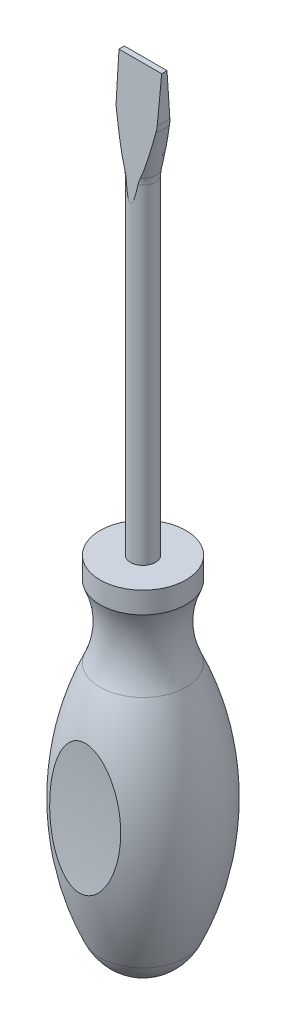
ISO-10303-21;
HEADER;
FILE_DESCRIPTION(('STEP AP214'),'2;1');
FILE_NAME('part.step','',(''),(''),'','','');
FILE_SCHEMA(('AUTOMOTIVE_DESIGN { 1 0 10303 214 1 1 1 1 }'));
ENDSEC;
DATA;
#1=APPLICATION_CONTEXT('core data for automotive mechanical design processes');
#2=APPLICATION_PROTOCOL_DEFINITION('international standard','automotive_design',2000,#1);
#3=PRODUCT_CONTEXT('',#1,'mechanical');
#4=PRODUCT('Part','Part','',(#3));
#5=PRODUCT_RELATED_PRODUCT_CATEGORY('part','',(#4));
#6=PRODUCT_DEFINITION_FORMATION('','',#4);
#7=PRODUCT_DEFINITION_CONTEXT('part definition',#1,'design');
#8=PRODUCT_DEFINITION('design','',#6,#7);
#9=PRODUCT_DEFINITION_SHAPE('','',#8);
#10=(LENGTH_UNIT() NAMED_UNIT(*) SI_UNIT(.MILLI.,.METRE.));
#11=(NAMED_UNIT(*) PLANE_ANGLE_UNIT() SI_UNIT($,.RADIAN.));
#12=(NAMED_UNIT(*) SI_UNIT($,.STERADIAN.) SOLID_ANGLE_UNIT());
#13=UNCERTAINTY_MEASURE_WITH_UNIT(LENGTH_MEASURE(1.E-05),#10,'distance_accuracy_value','');
#14=(GEOMETRIC_REPRESENTATION_CONTEXT(3) GLOBAL_UNCERTAINTY_ASSIGNED_CONTEXT((#13)) GLOBAL_UNIT_ASSIGNED_CONTEXT((#10,
#11,#12)) REPRESENTATION_CONTEXT('',''));
#15=CARTESIAN_POINT('',(0.,0.,0.));
#16=DIRECTION('',(0.,0.,1.));
#17=DIRECTION('',(1.,0.,0.));
#18=AXIS2_PLACEMENT_3D('',#15,#16,#17);
#19=CARTESIAN_POINT('',(0.,41.25,0.));
#20=DIRECTION('',(0.,1.,0.));
#21=DIRECTION('',(0.,0.,1.));
#22=AXIS2_PLACEMENT_3D('',#19,#20,#21);
#23=DEGENERATE_TOROIDAL_SURFACE('',#22,60.8075269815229,79.834193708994,.F.);
#24=CARTESIAN_POINT('',(0.,8.50000000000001,0.));
#25=DIRECTION('',(0.,1.,0.));
#26=DIRECTION('',(0.,0.,1.));
#27=AXIS2_PLACEMENT_3D('',#24,#25,#26);
#28=CIRCLE('',#27,12.);
#29=CARTESIAN_POINT('',(0.,8.50000000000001,12.));
#30=VERTEX_POINT('',#29);
#31=EDGE_CURVE('E167',#30,#30,#28,.T.);
#32=ORIENTED_EDGE('',*,*,#31,.T.);
#33=EDGE_LOOP('',(#32));
#34=FACE_BOUND('',#33,.T.);
#35=CARTESIAN_POINT('',(0.,74.,0.));
#36=DIRECTION('',(0.,1.,0.));
#37=DIRECTION('',(0.,0.,1.));
#38=AXIS2_PLACEMENT_3D('',#35,#36,#37);
#39=CIRCLE('',#38,12.);
#40=CARTESIAN_POINT('',(0.,74.,12.));
#41=VERTEX_POINT('',#40);
#42=EDGE_CURVE('E170',#41,#41,#39,.T.);
#43=ORIENTED_EDGE('',*,*,#42,.F.);
#44=EDGE_LOOP('',(#43));
#45=FACE_BOUND('',#44,.T.);
#46=CARTESIAN_POINT('',(-7.72043957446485,33.5090740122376,-16.9775024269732));
#47=CARTESIAN_POINT('',(-7.47341911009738,32.970534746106,-17.0322042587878));
#48=CARTESIAN_POINT('',(-7.20158457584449,32.4432461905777,-17.0879841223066));
#49=CARTESIAN_POINT('',(-6.75160292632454,31.6765659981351,-17.1719991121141));
#50=CARTESIAN_POINT('',(-6.59438050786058,31.4247926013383,-17.2000917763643));
#51=CARTESIAN_POINT('',(-6.26490240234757,30.93129914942,-17.2560688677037));
#52=CARTESIAN_POINT('',(-6.09265069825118,30.689576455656,-17.2839533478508));
#53=CARTESIAN_POINT('',(-5.72980185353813,30.215421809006,-17.3394878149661));
#54=CARTESIAN_POINT('',(-5.53900700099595,29.983138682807,-17.3671308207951));
#55=CARTESIAN_POINT('',(-5.13991651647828,29.53408335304,-17.4213179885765));
#56=CARTESIAN_POINT('',(-4.9316167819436,29.3173148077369,-17.4478618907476));
#57=CARTESIAN_POINT('',(-4.2799871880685,28.6969564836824,-17.5247874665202));
#58=CARTESIAN_POINT('',(-3.80820482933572,28.320967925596,-17.5727410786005));
#59=CARTESIAN_POINT('',(-3.00166198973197,27.8188960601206,-17.6378285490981));
#60=CARTESIAN_POINT('',(-2.6915299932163,27.6539155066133,-17.659485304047));
#61=CARTESIAN_POINT('',(-2.20966296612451,27.4443886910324,-17.6871780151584));
#62=CARTESIAN_POINT('',(-2.04625264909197,27.3808678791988,-17.6956105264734));
#63=CARTESIAN_POINT('',(-1.71464217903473,27.2677184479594,-17.7106750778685));
#64=CARTESIAN_POINT('',(-1.54644399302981,27.2180842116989,-17.7173078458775));
#65=CARTESIAN_POINT('',(-1.20475720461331,27.133453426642,-17.7286400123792));
#66=CARTESIAN_POINT('',(-1.03123519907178,27.0985886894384,-17.7333219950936));
#67=CARTESIAN_POINT('',(-0.681738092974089,27.0450335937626,-17.7405217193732));
#68=CARTESIAN_POINT('',(-0.505764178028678,27.0263356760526,-17.7430404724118));
#69=CARTESIAN_POINT('',(-0.15281609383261,27.0056099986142,-17.7458326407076));
#70=CARTESIAN_POINT('',(0.024158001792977,27.0035810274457,-17.746106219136));
#71=CARTESIAN_POINT('',(0.377443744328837,27.01621788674,-17.7444035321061));
#72=CARTESIAN_POINT('',(0.553755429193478,27.0308827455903,-17.7424273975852));
#73=CARTESIAN_POINT('',(1.04313162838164,27.0947062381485,-17.7338403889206));
#74=CARTESIAN_POINT('',(1.3539502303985,27.1619820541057,-17.7247987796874));
#75=CARTESIAN_POINT('',(1.96090495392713,27.3437137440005,-17.7005374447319));
#76=CARTESIAN_POINT('',(2.25703347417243,27.4581937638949,-17.6853145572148));
#77=CARTESIAN_POINT('',(2.9441981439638,27.7802870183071,-17.6428756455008));
#78=CARTESIAN_POINT('',(3.32619381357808,28.0068317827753,-17.6132976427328));
#79=CARTESIAN_POINT('',(4.04900634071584,28.5174658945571,-17.547768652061));
#80=CARTESIAN_POINT('',(4.38972491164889,28.8016884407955,-17.5118029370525));
#81=CARTESIAN_POINT('',(4.95900221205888,29.3431863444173,-17.4446518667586));
#82=CARTESIAN_POINT('',(5.19560354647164,29.5922732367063,-17.4141962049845));
#83=CARTESIAN_POINT('',(5.64616346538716,30.1101405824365,-17.3519488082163));
#84=CARTESIAN_POINT('',(5.86010924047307,30.3789320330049,-17.3201563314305));
#85=CARTESIAN_POINT('',(6.26713120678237,30.9322870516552,-17.2559149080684));
#86=CARTESIAN_POINT('',(6.46017707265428,31.2168726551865,-17.2234650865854));
#87=CARTESIAN_POINT('',(6.82669738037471,31.798416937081,-17.1584768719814));
#88=CARTESIAN_POINT('',(7.00016499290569,32.0953798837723,-17.1259384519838));
#89=CARTESIAN_POINT('',(7.44107468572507,32.9051526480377,-17.0391160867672));
#90=CARTESIAN_POINT('',(7.69193525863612,33.427061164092,-16.9851342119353));
#91=CARTESIAN_POINT('',(8.14797277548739,34.4907555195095,-16.8795185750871));
#92=CARTESIAN_POINT('',(8.35311994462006,35.0325540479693,-16.8278863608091));
#93=CARTESIAN_POINT('',(8.72216692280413,36.1311833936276,-16.7278402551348));
#94=CARTESIAN_POINT('',(8.88600116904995,36.6880365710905,-16.679431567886));
#95=CARTESIAN_POINT('',(9.175166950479,37.8117796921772,-16.5865778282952));
#96=CARTESIAN_POINT('',(9.30050313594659,38.3786684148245,-16.5421322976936));
#97=CARTESIAN_POINT('',(9.56178984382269,39.76775035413,-16.4392698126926));
#98=CARTESIAN_POINT('',(9.67864724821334,40.5937469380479,-16.3831838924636));
#99=CARTESIAN_POINT('',(9.8426695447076,42.253443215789,-16.2809501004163));
#100=CARTESIAN_POINT('',(9.88980068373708,43.0871464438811,-16.2348070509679));
#101=CARTESIAN_POINT('',(9.91655160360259,44.7567030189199,-16.1529196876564));
#102=CARTESIAN_POINT('',(9.89612423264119,45.5925574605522,-16.1171826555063));
#103=CARTESIAN_POINT('',(9.78797037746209,47.2600402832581,-16.0563398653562));
#104=CARTESIAN_POINT('',(9.7002704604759,48.0916702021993,-16.0312299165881));
#105=CARTESIAN_POINT('',(9.48438798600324,49.5519067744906,-15.9961637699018));
#106=CARTESIAN_POINT('',(9.37043360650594,50.1825909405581,-15.9840384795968));
#107=CARTESIAN_POINT('',(9.10016102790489,51.4351121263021,-15.9658104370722));
#108=CARTESIAN_POINT('',(8.94383639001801,52.0569477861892,-15.9597086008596));
#109=CARTESIAN_POINT('',(8.58658991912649,53.2857463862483,-15.9532748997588));
#110=CARTESIAN_POINT('',(8.38580317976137,53.8927483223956,-15.9529257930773));
#111=CARTESIAN_POINT('',(7.93528994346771,55.0881832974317,-15.9575394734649));
#112=CARTESIAN_POINT('',(7.68559684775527,55.6766286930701,-15.9624986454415));
#113=CARTESIAN_POINT('',(7.27199811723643,56.5347898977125,-15.9733626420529));
#114=CARTESIAN_POINT('',(7.12890177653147,56.8146426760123,-15.9775089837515));
#115=CARTESIAN_POINT('',(6.82840753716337,57.3665165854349,-15.9868135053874));
#116=CARTESIAN_POINT('',(6.67101292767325,57.6385394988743,-15.9919714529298));
#117=CARTESIAN_POINT('',(6.34072708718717,58.1731984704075,-16.0031654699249));
#118=CARTESIAN_POINT('',(6.16782876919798,58.4358301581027,-16.0092019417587));
#119=CARTESIAN_POINT('',(5.8053198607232,58.9493044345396,-16.0219743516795));
#120=CARTESIAN_POINT('',(5.61571203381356,59.2001489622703,-16.0287101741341));
#121=CARTESIAN_POINT('',(5.25641414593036,59.6404211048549,-16.0413162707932));
#122=CARTESIAN_POINT('',(5.08986510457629,59.8324097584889,-16.0471052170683));
#123=CARTESIAN_POINT('',(4.74409014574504,60.2047105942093,-16.0588371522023));
#124=CARTESIAN_POINT('',(4.56486294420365,60.3850215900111,-16.0647801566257));
#125=CARTESIAN_POINT('',(4.1933689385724,60.7310160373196,-16.0766181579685));
#126=CARTESIAN_POINT('',(4.00112916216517,60.8967282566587,-16.0825132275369));
#127=CARTESIAN_POINT('',(3.60288008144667,61.2106510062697,-16.094032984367));
#128=CARTESIAN_POINT('',(3.39687275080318,61.358864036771,-16.0996577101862));
#129=CARTESIAN_POINT('',(2.9015769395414,61.6786243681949,-16.1121014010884));
#130=CARTESIAN_POINT('',(2.60693215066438,61.8421717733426,-16.1187167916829));
#131=CARTESIAN_POINT('',(2.14864838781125,62.0511823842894,-16.1273582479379));
#132=CARTESIAN_POINT('',(1.99316250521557,62.1148022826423,-16.1300251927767));
#133=CARTESIAN_POINT('',(1.67736585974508,62.2286245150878,-16.1348398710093));
#134=CARTESIAN_POINT('',(1.51705727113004,62.2788327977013,-16.136987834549));
#135=CARTESIAN_POINT('',(1.1908520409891,62.3650365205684,-16.140698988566));
#136=CARTESIAN_POINT('',(1.02491463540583,62.4008788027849,-16.1422558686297));
#137=CARTESIAN_POINT('',(0.690438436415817,62.456560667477,-16.1446829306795));
#138=CARTESIAN_POINT('',(0.521900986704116,62.4764082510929,-16.1455534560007));
#139=CARTESIAN_POINT('',(0.183710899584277,62.4995013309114,-16.1465668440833));
#140=CARTESIAN_POINT('',(0.0140585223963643,62.5027505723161,-16.1467098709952));
#141=CARTESIAN_POINT('',(-0.324690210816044,62.4925816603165,-16.146263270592));
#142=CARTESIAN_POINT('',(-0.493786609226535,62.4791648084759,-16.1456737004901));
#143=CARTESIAN_POINT('',(-0.954795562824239,62.4199594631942,-16.1430837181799));
#144=CARTESIAN_POINT('',(-1.24470320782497,62.3575345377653,-16.1403609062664));
#145=CARTESIAN_POINT('',(-1.81101077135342,62.188472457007,-16.1331246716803));
#146=CARTESIAN_POINT('',(-2.08740288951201,62.0818100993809,-16.1286102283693));
#147=CARTESIAN_POINT('',(-2.73866169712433,61.7775072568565,-16.1160674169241));
#148=CARTESIAN_POINT('',(-3.10442151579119,61.5604705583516,-16.1073637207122));
#149=CARTESIAN_POINT('',(-3.79720300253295,61.0715061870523,-16.0887780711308));
#150=CARTESIAN_POINT('',(-4.12412424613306,60.7994409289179,-16.0788931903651));
#151=CARTESIAN_POINT('',(-4.68204093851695,60.2720294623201,-16.0609791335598));
#152=CARTESIAN_POINT('',(-4.91945722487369,60.0233379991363,-16.0529544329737));
#153=CARTESIAN_POINT('',(-5.37194606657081,59.506229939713,-16.0373165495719));
#154=CARTESIAN_POINT('',(-5.58700428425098,59.237800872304,-16.029703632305));
#155=CARTESIAN_POINT('',(-5.99683103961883,58.6853477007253,-16.0152173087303));
#156=CARTESIAN_POINT('',(-6.19156815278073,58.4013004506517,-16.0083450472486));
#157=CARTESIAN_POINT('',(-6.56221653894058,57.8210785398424,-15.9956004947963));
#158=CARTESIAN_POINT('',(-6.73812108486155,57.5248995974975,-15.9897285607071));
#159=CARTESIAN_POINT('',(-7.05217821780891,56.9595543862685,-15.9798204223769));
#160=CARTESIAN_POINT('',(-7.19231980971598,56.6914882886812,-15.9756477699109));
#161=CARTESIAN_POINT('',(-7.4600652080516,56.1491340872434,-15.9683222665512));
#162=CARTESIAN_POINT('',(-7.5876671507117,55.8748450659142,-15.9651695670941));
#163=CARTESIAN_POINT('',(-7.95290570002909,55.0439309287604,-15.9573662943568));
#164=CARTESIAN_POINT('',(-8.17286824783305,54.4794545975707,-15.9543740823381));
#165=CARTESIAN_POINT('',(-8.57045058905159,53.3349361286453,-15.9532944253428));
#166=CARTESIAN_POINT('',(-8.74799799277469,52.7548692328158,-15.9552153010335));
#167=CARTESIAN_POINT('',(-9.06343237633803,51.5842717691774,-15.9642858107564));
#168=CARTESIAN_POINT('',(-9.20132553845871,50.9937428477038,-15.9714346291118));
#169=CARTESIAN_POINT('',(-9.48727739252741,49.5678429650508,-15.9951097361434));
#170=CARTESIAN_POINT('',(-9.61739899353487,48.728884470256,-16.0142410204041));
#171=CARTESIAN_POINT('',(-9.80762439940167,47.043131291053,-16.0634258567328));
#172=CARTESIAN_POINT('',(-9.86769500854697,46.196333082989,-16.0934845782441));
#173=CARTESIAN_POINT('',(-9.91860138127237,44.5010453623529,-16.1644997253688));
#174=CARTESIAN_POINT('',(-9.90943143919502,43.6525557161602,-16.2054570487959));
#175=CARTESIAN_POINT('',(-9.82065984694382,41.9600990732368,-16.2979477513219));
#176=CARTESIAN_POINT('',(-9.74109170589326,41.1161301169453,-16.3494760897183));
#177=CARTESIAN_POINT('',(-9.54350868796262,39.693674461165,-16.4452901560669));
#178=CARTESIAN_POINT('',(-9.44448447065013,39.1123335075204,-16.4870295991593));
#179=CARTESIAN_POINT('',(-9.20867597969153,37.9575600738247,-16.5749570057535));
#180=CARTESIAN_POINT('',(-9.07188868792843,37.3841282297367,-16.6211453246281));
#181=CARTESIAN_POINT('',(-8.75840751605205,36.2505166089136,-16.7172966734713));
#182=CARTESIAN_POINT('',(-8.58184463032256,35.6902998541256,-16.7672469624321));
#183=CARTESIAN_POINT('',(-8.1850865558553,34.5860792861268,-16.8702815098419));
#184=CARTESIAN_POINT('',(-7.96491584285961,34.0420665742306,-16.9233639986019));
#185=CARTESIAN_POINT('',(-7.72043957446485,33.5090740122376,-16.9775024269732));
#186=B_SPLINE_CURVE_WITH_KNOTS('',3,(#46,#47,#48,#49,#50,#51,#52,#53,#54,#55,#56,#57,#58,#59,
#60,#61,#62,#63,#64,#65,#66,#67,#68,#69,#70,#71,#72,#73,#74,#75,#76,#77,#78,#79,#80,#81,#82,#83,
#84,#85,#86,#87,#88,#89,#90,#91,#92,#93,#94,#95,#96,#97,#98,#99,#100,#101,#102,#103,#104,#105,
#106,#107,#108,#109,#110,#111,#112,#113,#114,#115,#116,#117,#118,#119,#120,#121,#122,#123,#124,
#125,#126,#127,#128,#129,#130,#131,#132,#133,#134,#135,#136,#137,#138,#139,#140,#141,#142,#143,
#144,#145,#146,#147,#148,#149,#150,#151,#152,#153,#154,#155,#156,#157,#158,#159,#160,#161,#162,
#163,#164,#165,#166,#167,#168,#169,#170,#171,#172,#173,#174,#175,#176,#177,#178,#179,#180,#181,
#182,#183,#184,#185),.UNSPECIFIED.,.T.,.F.,(4,2,2,2,2,2,2,2,2,2,2,2,2,2,2,2,2,2,2,2,2,2,2,2,2,2,
2,2,2,2,2,2,2,2,2,2,2,2,2,2,2,2,2,2,2,2,2,2,2,2,2,2,2,2,2,2,2,2,2,2,2,2,2,2,2,2,2,2,2,4),(0.,
1.78422981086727,2.67825304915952,3.57204007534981,4.47670196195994,5.38157646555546,
7.18264764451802,8.23458024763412,8.76060659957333,9.28641987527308,9.8168317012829,
10.3469953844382,10.8771205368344,11.4072148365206,12.3569956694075,13.3072629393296,
14.6350997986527,15.9660387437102,16.999331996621,18.0332063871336,19.0685613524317,
20.1042763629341,21.8462629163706,23.5893807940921,25.3352477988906,27.0809038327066,
29.5858069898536,32.0919223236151,34.5997871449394,37.1066620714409,39.028369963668,
40.9503700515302,42.8666085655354,44.7815428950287,45.7242322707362,46.6667053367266,
47.6096114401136,48.5523618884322,49.3145411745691,50.0767977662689,50.8375170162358,
51.5981274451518,52.6051901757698,53.1087535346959,53.6120931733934,54.1206647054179,
54.6289816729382,55.1371839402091,55.6453465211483,56.5307088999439,57.4165763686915,
58.6855578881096,59.9577522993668,60.9880858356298,62.0190760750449,63.0516377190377,
64.0845669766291,64.9917672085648,65.8991020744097,67.7144387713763,69.5328519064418,
71.3509813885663,73.8952797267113,76.4407832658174,78.9864965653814,81.5309987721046,
83.303453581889,85.0760500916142,86.8428920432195,88.60874511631),.UNSPECIFIED.);
#187=CARTESIAN_POINT('',(-7.72043957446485,33.5090740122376,-16.9775024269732));
#188=VERTEX_POINT('',#187);
#189=EDGE_CURVE('E171',#188,#188,#186,.T.);
#190=ORIENTED_EDGE('',*,*,#189,.T.);
#191=EDGE_LOOP('',(#190));
#192=FACE_BOUND('',#191,.T.);
#193=CARTESIAN_POINT('',(-7.72043957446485,33.5090740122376,16.9775024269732));
#194=CARTESIAN_POINT('',(-7.47341911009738,32.970534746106,17.0322042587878));
#195=CARTESIAN_POINT('',(-7.20158457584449,32.4432461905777,17.0879841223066));
#196=CARTESIAN_POINT('',(-6.75160292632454,31.6765659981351,17.1719991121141));
#197=CARTESIAN_POINT('',(-6.59438050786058,31.4247926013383,17.2000917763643));
#198=CARTESIAN_POINT('',(-6.26490240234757,30.93129914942,17.2560688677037));
#199=CARTESIAN_POINT('',(-6.09265069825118,30.689576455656,17.2839533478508));
#200=CARTESIAN_POINT('',(-5.72980185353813,30.215421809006,17.3394878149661));
#201=CARTESIAN_POINT('',(-5.53900700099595,29.983138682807,17.3671308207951));
#202=CARTESIAN_POINT('',(-5.13991651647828,29.53408335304,17.4213179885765));
#203=CARTESIAN_POINT('',(-4.9316167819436,29.3173148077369,17.4478618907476));
#204=CARTESIAN_POINT('',(-4.2799871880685,28.6969564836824,17.5247874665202));
#205=CARTESIAN_POINT('',(-3.80820482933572,28.320967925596,17.5727410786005));
#206=CARTESIAN_POINT('',(-3.00166198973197,27.8188960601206,17.6378285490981));
#207=CARTESIAN_POINT('',(-2.6915299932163,27.6539155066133,17.659485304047));
#208=CARTESIAN_POINT('',(-2.20966296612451,27.4443886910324,17.6871780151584));
#209=CARTESIAN_POINT('',(-2.04625264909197,27.3808678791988,17.6956105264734));
#210=CARTESIAN_POINT('',(-1.71464217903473,27.2677184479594,17.7106750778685));
#211=CARTESIAN_POINT('',(-1.54644399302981,27.2180842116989,17.7173078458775));
#212=CARTESIAN_POINT('',(-1.20475720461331,27.133453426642,17.7286400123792));
#213=CARTESIAN_POINT('',(-1.03123519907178,27.0985886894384,17.7333219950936));
#214=CARTESIAN_POINT('',(-0.681738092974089,27.0450335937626,17.7405217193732));
#215=CARTESIAN_POINT('',(-0.505764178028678,27.0263356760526,17.7430404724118));
#216=CARTESIAN_POINT('',(-0.15281609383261,27.0056099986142,17.7458326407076));
#217=CARTESIAN_POINT('',(0.024158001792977,27.0035810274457,17.746106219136));
#218=CARTESIAN_POINT('',(0.377443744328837,27.01621788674,17.7444035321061));
#219=CARTESIAN_POINT('',(0.553755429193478,27.0308827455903,17.7424273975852));
#220=CARTESIAN_POINT('',(1.04313162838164,27.0947062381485,17.7338403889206));
#221=CARTESIAN_POINT('',(1.3539502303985,27.1619820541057,17.7247987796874));
#222=CARTESIAN_POINT('',(1.96090495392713,27.3437137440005,17.7005374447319));
#223=CARTESIAN_POINT('',(2.25703347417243,27.4581937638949,17.6853145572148));
#224=CARTESIAN_POINT('',(2.9441981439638,27.7802870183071,17.6428756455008));
#225=CARTESIAN_POINT('',(3.32619381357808,28.0068317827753,17.6132976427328));
#226=CARTESIAN_POINT('',(4.04900634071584,28.5174658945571,17.547768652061));
#227=CARTESIAN_POINT('',(4.38972491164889,28.8016884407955,17.5118029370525));
#228=CARTESIAN_POINT('',(4.95900221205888,29.3431863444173,17.4446518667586));
#229=CARTESIAN_POINT('',(5.19560354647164,29.5922732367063,17.4141962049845));
#230=CARTESIAN_POINT('',(5.64616346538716,30.1101405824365,17.3519488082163));
#231=CARTESIAN_POINT('',(5.86010924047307,30.3789320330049,17.3201563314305));
#232=CARTESIAN_POINT('',(6.26713120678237,30.9322870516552,17.2559149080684));
#233=CARTESIAN_POINT('',(6.46017707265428,31.2168726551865,17.2234650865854));
#234=CARTESIAN_POINT('',(6.82669738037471,31.798416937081,17.1584768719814));
#235=CARTESIAN_POINT('',(7.00016499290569,32.0953798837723,17.1259384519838));
#236=CARTESIAN_POINT('',(7.44107468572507,32.9051526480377,17.0391160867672));
#237=CARTESIAN_POINT('',(7.69193525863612,33.427061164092,16.9851342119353));
#238=CARTESIAN_POINT('',(8.14797277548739,34.4907555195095,16.8795185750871));
#239=CARTESIAN_POINT('',(8.35311994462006,35.0325540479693,16.8278863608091));
#240=CARTESIAN_POINT('',(8.72216692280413,36.1311833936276,16.7278402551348));
#241=CARTESIAN_POINT('',(8.88600116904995,36.6880365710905,16.679431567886));
#242=CARTESIAN_POINT('',(9.175166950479,37.8117796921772,16.5865778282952));
#243=CARTESIAN_POINT('',(9.30050313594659,38.3786684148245,16.5421322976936));
#244=CARTESIAN_POINT('',(9.56178984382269,39.76775035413,16.4392698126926));
#245=CARTESIAN_POINT('',(9.67864724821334,40.5937469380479,16.3831838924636));
#246=CARTESIAN_POINT('',(9.8426695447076,42.253443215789,16.2809501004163));
#247=CARTESIAN_POINT('',(9.88980068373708,43.0871464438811,16.2348070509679));
#248=CARTESIAN_POINT('',(9.91655160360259,44.7567030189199,16.1529196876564));
#249=CARTESIAN_POINT('',(9.89612423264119,45.5925574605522,16.1171826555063));
#250=CARTESIAN_POINT('',(9.78797037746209,47.2600402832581,16.0563398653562));
#251=CARTESIAN_POINT('',(9.7002704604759,48.0916702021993,16.0312299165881));
#252=CARTESIAN_POINT('',(9.48438798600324,49.5519067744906,15.9961637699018));
#253=CARTESIAN_POINT('',(9.37043360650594,50.1825909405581,15.9840384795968));
#254=CARTESIAN_POINT('',(9.10016102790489,51.4351121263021,15.9658104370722));
#255=CARTESIAN_POINT('',(8.94383639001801,52.0569477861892,15.9597086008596));
#256=CARTESIAN_POINT('',(8.58658991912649,53.2857463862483,15.9532748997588));
#257=CARTESIAN_POINT('',(8.38580317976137,53.8927483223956,15.9529257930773));
#258=CARTESIAN_POINT('',(7.93528994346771,55.0881832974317,15.9575394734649));
#259=CARTESIAN_POINT('',(7.68559684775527,55.6766286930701,15.9624986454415));
#260=CARTESIAN_POINT('',(7.27199811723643,56.5347898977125,15.9733626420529));
#261=CARTESIAN_POINT('',(7.12890177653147,56.8146426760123,15.9775089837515));
#262=CARTESIAN_POINT('',(6.82840753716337,57.3665165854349,15.9868135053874));
#263=CARTESIAN_POINT('',(6.67101292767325,57.6385394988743,15.9919714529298));
#264=CARTESIAN_POINT('',(6.34072708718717,58.1731984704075,16.0031654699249));
#265=CARTESIAN_POINT('',(6.16782876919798,58.4358301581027,16.0092019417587));
#266=CARTESIAN_POINT('',(5.8053198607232,58.9493044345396,16.0219743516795));
#267=CARTESIAN_POINT('',(5.61571203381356,59.2001489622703,16.0287101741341));
#268=CARTESIAN_POINT('',(5.25641414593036,59.6404211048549,16.0413162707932));
#269=CARTESIAN_POINT('',(5.08986510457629,59.8324097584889,16.0471052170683));
#270=CARTESIAN_POINT('',(4.74409014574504,60.2047105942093,16.0588371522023));
#271=CARTESIAN_POINT('',(4.56486294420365,60.3850215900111,16.0647801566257));
#272=CARTESIAN_POINT('',(4.1933689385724,60.7310160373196,16.0766181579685));
#273=CARTESIAN_POINT('',(4.00112916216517,60.8967282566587,16.0825132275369));
#274=CARTESIAN_POINT('',(3.60288008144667,61.2106510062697,16.094032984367));
#275=CARTESIAN_POINT('',(3.39687275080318,61.358864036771,16.0996577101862));
#276=CARTESIAN_POINT('',(2.9015769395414,61.6786243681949,16.1121014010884));
#277=CARTESIAN_POINT('',(2.60693215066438,61.8421717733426,16.1187167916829));
#278=CARTESIAN_POINT('',(2.14864838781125,62.0511823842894,16.1273582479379));
#279=CARTESIAN_POINT('',(1.99316250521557,62.1148022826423,16.1300251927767));
#280=CARTESIAN_POINT('',(1.67736585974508,62.2286245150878,16.1348398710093));
#281=CARTESIAN_POINT('',(1.51705727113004,62.2788327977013,16.136987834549));
#282=CARTESIAN_POINT('',(1.1908520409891,62.3650365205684,16.140698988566));
#283=CARTESIAN_POINT('',(1.02491463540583,62.4008788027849,16.1422558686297));
#284=CARTESIAN_POINT('',(0.690438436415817,62.456560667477,16.1446829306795));
#285=CARTESIAN_POINT('',(0.521900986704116,62.4764082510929,16.1455534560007));
#286=CARTESIAN_POINT('',(0.183710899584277,62.4995013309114,16.1465668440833));
#287=CARTESIAN_POINT('',(0.0140585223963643,62.5027505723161,16.1467098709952));
#288=CARTESIAN_POINT('',(-0.324690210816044,62.4925816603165,16.146263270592));
#289=CARTESIAN_POINT('',(-0.493786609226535,62.4791648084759,16.1456737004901));
#290=CARTESIAN_POINT('',(-0.954795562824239,62.4199594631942,16.1430837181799));
#291=CARTESIAN_POINT('',(-1.24470320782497,62.3575345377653,16.1403609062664));
#292=CARTESIAN_POINT('',(-1.81101077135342,62.188472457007,16.1331246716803));
#293=CARTESIAN_POINT('',(-2.08740288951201,62.0818100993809,16.1286102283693));
#294=CARTESIAN_POINT('',(-2.73866169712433,61.7775072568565,16.1160674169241));
#295=CARTESIAN_POINT('',(-3.10442151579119,61.5604705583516,16.1073637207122));
#296=CARTESIAN_POINT('',(-3.79720300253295,61.0715061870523,16.0887780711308));
#297=CARTESIAN_POINT('',(-4.12412424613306,60.7994409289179,16.0788931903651));
#298=CARTESIAN_POINT('',(-4.68204093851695,60.2720294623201,16.0609791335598));
#299=CARTESIAN_POINT('',(-4.91945722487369,60.0233379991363,16.0529544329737));
#300=CARTESIAN_POINT('',(-5.37194606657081,59.506229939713,16.0373165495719));
#301=CARTESIAN_POINT('',(-5.58700428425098,59.237800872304,16.029703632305));
#302=CARTESIAN_POINT('',(-5.99683103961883,58.6853477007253,16.0152173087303));
#303=CARTESIAN_POINT('',(-6.19156815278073,58.4013004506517,16.0083450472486));
#304=CARTESIAN_POINT('',(-6.56221653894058,57.8210785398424,15.9956004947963));
#305=CARTESIAN_POINT('',(-6.73812108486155,57.5248995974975,15.9897285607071));
#306=CARTESIAN_POINT('',(-7.05217821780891,56.9595543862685,15.9798204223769));
#307=CARTESIAN_POINT('',(-7.19231980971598,56.6914882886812,15.9756477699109));
#308=CARTESIAN_POINT('',(-7.4600652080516,56.1491340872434,15.9683222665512));
#309=CARTESIAN_POINT('',(-7.5876671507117,55.8748450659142,15.9651695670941));
#310=CARTESIAN_POINT('',(-7.95290570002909,55.0439309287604,15.9573662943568));
#311=CARTESIAN_POINT('',(-8.17286824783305,54.4794545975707,15.9543740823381));
#312=CARTESIAN_POINT('',(-8.57045058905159,53.3349361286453,15.9532944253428));
#313=CARTESIAN_POINT('',(-8.74799799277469,52.7548692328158,15.9552153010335));
#314=CARTESIAN_POINT('',(-9.06343237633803,51.5842717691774,15.9642858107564));
#315=CARTESIAN_POINT('',(-9.20132553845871,50.9937428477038,15.9714346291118));
#316=CARTESIAN_POINT('',(-9.48727739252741,49.5678429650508,15.9951097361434));
#317=CARTESIAN_POINT('',(-9.61739899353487,48.728884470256,16.0142410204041));
#318=CARTESIAN_POINT('',(-9.80762439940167,47.043131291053,16.0634258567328));
#319=CARTESIAN_POINT('',(-9.86769500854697,46.196333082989,16.0934845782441));
#320=CARTESIAN_POINT('',(-9.91860138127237,44.5010453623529,16.1644997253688));
#321=CARTESIAN_POINT('',(-9.90943143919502,43.6525557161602,16.2054570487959));
#322=CARTESIAN_POINT('',(-9.82065984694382,41.9600990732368,16.2979477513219));
#323=CARTESIAN_POINT('',(-9.74109170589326,41.1161301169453,16.3494760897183));
#324=CARTESIAN_POINT('',(-9.54350868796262,39.693674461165,16.4452901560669));
#325=CARTESIAN_POINT('',(-9.44448447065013,39.1123335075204,16.4870295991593));
#326=CARTESIAN_POINT('',(-9.20867597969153,37.9575600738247,16.5749570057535));
#327=CARTESIAN_POINT('',(-9.07188868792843,37.3841282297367,16.6211453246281));
#328=CARTESIAN_POINT('',(-8.75840751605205,36.2505166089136,16.7172966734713));
#329=CARTESIAN_POINT('',(-8.58184463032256,35.6902998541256,16.7672469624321));
#330=CARTESIAN_POINT('',(-8.1850865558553,34.5860792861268,16.8702815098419));
#331=CARTESIAN_POINT('',(-7.96491584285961,34.0420665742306,16.9233639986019));
#332=CARTESIAN_POINT('',(-7.72043957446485,33.5090740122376,16.9775024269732));
#333=B_SPLINE_CURVE_WITH_KNOTS('',3,(#193,#194,#195,#196,#197,#198,#199,#200,#201,#202,#203,
#204,#205,#206,#207,#208,#209,#210,#211,#212,#213,#214,#215,#216,#217,#218,#219,#220,#221,#222,
#223,#224,#225,#226,#227,#228,#229,#230,#231,#232,#233,#234,#235,#236,#237,#238,#239,#240,#241,
#242,#243,#244,#245,#246,#247,#248,#249,#250,#251,#252,#253,#254,#255,#256,#257,#258,#259,#260,
#261,#262,#263,#264,#265,#266,#267,#268,#269,#270,#271,#272,#273,#274,#275,#276,#277,#278,#279,
#280,#281,#282,#283,#284,#285,#286,#287,#288,#289,#290,#291,#292,#293,#294,#295,#296,#297,#298,
#299,#300,#301,#302,#303,#304,#305,#306,#307,#308,#309,#310,#311,#312,#313,#314,#315,#316,#317,
#318,#319,#320,#321,#322,#323,#324,#325,#326,#327,#328,#329,#330,#331,#332),.UNSPECIFIED.,.T.,
.F.,(4,2,2,2,2,2,2,2,2,2,2,2,2,2,2,2,2,2,2,2,2,2,2,2,2,2,2,2,2,2,2,2,2,2,2,2,2,2,2,2,2,2,2,2,2,
2,2,2,2,2,2,2,2,2,2,2,2,2,2,2,2,2,2,2,2,2,2,2,2,4),(0.,1.78422981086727,2.67825304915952,
3.57204007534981,4.47670196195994,5.38157646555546,7.18264764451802,8.23458024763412,
8.76060659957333,9.28641987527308,9.8168317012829,10.3469953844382,10.8771205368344,
11.4072148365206,12.3569956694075,13.3072629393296,14.6350997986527,15.9660387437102,
16.999331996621,18.0332063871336,19.0685613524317,20.1042763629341,21.8462629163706,
23.5893807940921,25.3352477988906,27.0809038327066,29.5858069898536,32.0919223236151,
34.5997871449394,37.1066620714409,39.028369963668,40.9503700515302,42.8666085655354,
44.7815428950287,45.7242322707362,46.6667053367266,47.6096114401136,48.5523618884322,
49.3145411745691,50.0767977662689,50.8375170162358,51.5981274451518,52.6051901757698,
53.1087535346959,53.6120931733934,54.1206647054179,54.6289816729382,55.1371839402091,
55.6453465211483,56.5307088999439,57.4165763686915,58.6855578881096,59.9577522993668,
60.9880858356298,62.0190760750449,63.0516377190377,64.0845669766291,64.9917672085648,
65.8991020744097,67.7144387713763,69.5328519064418,71.3509813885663,73.8952797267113,
76.4407832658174,78.9864965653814,81.5309987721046,83.303453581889,85.0760500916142,
86.8428920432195,88.60874511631),.UNSPECIFIED.);
#334=CARTESIAN_POINT('',(-7.72043957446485,33.5090740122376,16.9775024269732));
#335=VERTEX_POINT('',#334);
#336=EDGE_CURVE('E182',#335,#335,#333,.T.);
#337=ORIENTED_EDGE('',*,*,#336,.F.);
#338=EDGE_LOOP('',(#337));
#339=FACE_BOUND('',#338,.T.);
#340=ADVANCED_FACE('F36',(#34,#45,#192,#339),#23,.F.);
#341=CARTESIAN_POINT('',(0.,100.,-12.));
#342=DIRECTION('',(0.,-1.,0.));
#343=DIRECTION('',(0.,0.,-1.));
#344=AXIS2_PLACEMENT_3D('',#341,#342,#343);
#345=PLANE('',#344);
#346=CARTESIAN_POINT('',(0.,100.,0.));
#347=DIRECTION('',(0.,-1.,0.));
#348=DIRECTION('',(0.,0.,-1.));
#349=AXIS2_PLACEMENT_3D('',#346,#347,#348);
#350=CIRCLE('',#349,3.50000000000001);
#351=CARTESIAN_POINT('',(0.,100.,-3.50000000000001));
#352=VERTEX_POINT('',#351);
#353=EDGE_CURVE('E40',#352,#352,#350,.T.);
#354=ORIENTED_EDGE('',*,*,#353,.T.);
#355=EDGE_LOOP('',(#354));
#356=FACE_BOUND('',#355,.T.);
#357=CARTESIAN_POINT('',(0.,100.,0.));
#358=DIRECTION('',(0.,1.,0.));
#359=DIRECTION('',(0.,0.,1.));
#360=AXIS2_PLACEMENT_3D('',#357,#358,#359);
#361=CIRCLE('',#360,12.);
#362=CARTESIAN_POINT('',(0.,100.,12.));
#363=VERTEX_POINT('',#362);
#364=EDGE_CURVE('E11',#363,#363,#361,.T.);
#365=ORIENTED_EDGE('',*,*,#364,.T.);
#366=EDGE_LOOP('',(#365));
#367=FACE_BOUND('',#366,.T.);
#368=ADVANCED_FACE('F38',(#356,#367),#345,.F.);
#369=CARTESIAN_POINT('',(0.,100.,0.));
#370=DIRECTION('',(0.,1.,0.));
#371=DIRECTION('',(0.,0.,1.));
#372=AXIS2_PLACEMENT_3D('',#369,#370,#371);
#373=CYLINDRICAL_SURFACE('',#372,12.);
#374=ORIENTED_EDGE('',*,*,#364,.F.);
#375=EDGE_LOOP('',(#374));
#376=FACE_BOUND('',#375,.T.);
#377=CARTESIAN_POINT('',(0.,94.,0.));
#378=DIRECTION('',(0.,1.,0.));
#379=DIRECTION('',(0.,0.,1.));
#380=AXIS2_PLACEMENT_3D('',#377,#378,#379);
#381=CIRCLE('',#380,12.);
#382=CARTESIAN_POINT('',(0.,94.,12.));
#383=VERTEX_POINT('',#382);
#384=EDGE_CURVE('E45',#383,#383,#381,.T.);
#385=ORIENTED_EDGE('',*,*,#384,.T.);
#386=EDGE_LOOP('',(#385));
#387=FACE_BOUND('',#386,.T.);
#388=ADVANCED_FACE('F204',(#376,#387),#373,.T.);
#389=CARTESIAN_POINT('',(0.,84.,0.));
#390=DIRECTION('',(0.,1.,0.));
#391=DIRECTION('',(0.,0.,1.));
#392=AXIS2_PLACEMENT_3D('',#389,#390,#391);
#393=TOROIDAL_SURFACE('',#392,34.2313059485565,24.3768530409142);
#394=ORIENTED_EDGE('',*,*,#384,.F.);
#395=EDGE_LOOP('',(#394));
#396=FACE_BOUND('',#395,.T.);
#397=ORIENTED_EDGE('',*,*,#42,.T.);
#398=EDGE_LOOP('',(#397));
#399=FACE_BOUND('',#398,.T.);
#400=ADVANCED_FACE('F199',(#396,#399),#393,.F.);
#401=CARTESIAN_POINT('',(0.,14.448265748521,-1.22377157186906));
#402=DIRECTION('',(-1.,0.,0.));
#403=DIRECTION('',(0.,0.,1.));
#404=AXIS2_PLACEMENT_3D('',#401,#402,#403);
#405=CIRCLE('',#404,14.5);
#406=TRIMMED_CURVE('',#405,(PARAMETER_VALUE(-1.4862977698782)),
(PARAMETER_VALUE(1.4862977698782)),.T.,.PARAMETER.);
#407=CARTESIAN_POINT('',(0.,14.448265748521,0.));
#408=DIRECTION('',(0.,1.,0.));
#409=AXIS1_PLACEMENT('',#407,#408);
#410=SURFACE_OF_REVOLUTION('',#406,#409);
#411=ORIENTED_EDGE('',*,*,#31,.F.);
#412=EDGE_LOOP('',(#411));
#413=FACE_BOUND('',#412,.T.);
#414=CARTESIAN_POINT('',(0.,0.,0.));
#415=VERTEX_POINT('',#414);
#416=VERTEX_LOOP('',#415);
#417=FACE_BOUND('',#416,.T.);
#418=ADVANCED_FACE('F194',(#413,#417),#410,.T.);
#419=CARTESIAN_POINT('',(-19.0266667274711,53.7193366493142,-215.953746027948));
#420=DIRECTION('',(1.,0.,0.));
#421=DIRECTION('',(0.,0.,-1.));
#422=AXIS2_PLACEMENT_3D('',#419,#420,#421);
#423=CYLINDRICAL_SURFACE('',#422,200.);
#424=ORIENTED_EDGE('',*,*,#189,.F.);
#425=EDGE_LOOP('',(#424));
#426=FACE_BOUND('',#425,.T.);
#427=ADVANCED_FACE('F190',(#426),#423,.F.);
#428=CARTESIAN_POINT('',(-19.0266667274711,53.7193366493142,215.953746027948));
#429=DIRECTION('',(1.,0.,0.));
#430=DIRECTION('',(0.,0.,-1.));
#431=AXIS2_PLACEMENT_3D('',#428,#429,#430);
#432=CYLINDRICAL_SURFACE('',#431,200.);
#433=ORIENTED_EDGE('',*,*,#336,.T.);
#434=EDGE_LOOP('',(#433));
#435=FACE_BOUND('',#434,.T.);
#436=ADVANCED_FACE('F193',(#435),#432,.F.);
#437=CARTESIAN_POINT('',(0.,30.,0.));
#438=DIRECTION('',(0.,-1.,0.));
#439=DIRECTION('',(0.,0.,-1.));
#440=AXIS2_PLACEMENT_3D('',#437,#438,#439);
#441=CYLINDRICAL_SURFACE('',#440,3.50000000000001);
#442=CARTESIAN_POINT('',(0.,229.,0.));
#443=DIRECTION('',(0.,-0.08304547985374,0.99654575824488));
#444=DIRECTION('',(0.,-0.99654575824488,-0.08304547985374));
#445=AXIS2_PLACEMENT_3D('',#442,#443,#444);
#446=ELLIPSE('',#445,42.1455810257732,3.50000000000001);
#447=CARTESIAN_POINT('',(1.67380559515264,192.114149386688,-3.07382088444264));
#448=VERTEX_POINT('',#447);
#449=CARTESIAN_POINT('',(-1.67380559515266,192.114149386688,-3.07382088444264));
#450=VERTEX_POINT('',#449);
#451=EDGE_CURVE('E314',#448,#450,#446,.F.);
#452=ORIENTED_EDGE('',*,*,#451,.F.);
#453=CARTESIAN_POINT('',(0.,192.114149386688,0.));
#454=DIRECTION('',(0.,-1.,0.));
#455=DIRECTION('',(0.,0.,-1.));
#456=AXIS2_PLACEMENT_3D('',#453,#454,#455);
#457=CIRCLE('',#456,3.5);
#458=CARTESIAN_POINT('',(1.67380559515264,192.114149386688,3.07382088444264));
#459=VERTEX_POINT('',#458);
#460=EDGE_CURVE('E162',#448,#459,#457,.T.);
#461=ORIENTED_EDGE('',*,*,#460,.T.);
#462=CARTESIAN_POINT('',(0.,229.,0.));
#463=DIRECTION('',(0.,0.08304547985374,0.99654575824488));
#464=DIRECTION('',(0.,-0.99654575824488,0.08304547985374));
#465=AXIS2_PLACEMENT_3D('',#462,#463,#464);
#466=ELLIPSE('',#465,42.1455810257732,3.50000000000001);
#467=CARTESIAN_POINT('',(-1.67380559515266,192.114149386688,3.07382088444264));
#468=VERTEX_POINT('',#467);
#469=EDGE_CURVE('E292',#459,#468,#466,.F.);
#470=ORIENTED_EDGE('',*,*,#469,.T.);
#471=EDGE_CURVE('E161',#468,#450,#457,.T.);
#472=ORIENTED_EDGE('',*,*,#471,.T.);
#473=EDGE_LOOP('',(#452,#461,#470,#472));
#474=FACE_BOUND('',#473,.T.);
#475=ORIENTED_EDGE('',*,*,#353,.F.);
#476=EDGE_LOOP('',(#475));
#477=FACE_BOUND('',#476,.T.);
#478=ADVANCED_FACE('F301',(#474,#477),#441,.T.);
#479=CARTESIAN_POINT('',(0.,220.,0.));
#480=DIRECTION('',(0.,1.,0.));
#481=DIRECTION('',(0.,0.,1.));
#482=AXIS2_PLACEMENT_3D('',#479,#480,#481);
#483=PLANE('',#482);
#484=DIRECTION('',(1.,0.,0.));
#485=VECTOR('',#484,1.);
#486=CARTESIAN_POINT('',(-10.,220.,-0.750000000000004));
#487=LINE('',#486,#485);
#488=CARTESIAN_POINT('',(-5.95294044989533,220.,-0.750000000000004));
#489=VERTEX_POINT('',#488);
#490=CARTESIAN_POINT('',(5.95294044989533,220.,-0.750000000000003));
#491=VERTEX_POINT('',#490);
#492=EDGE_CURVE('E123',#489,#491,#487,.T.);
#493=ORIENTED_EDGE('',*,*,#492,.F.);
#494=CARTESIAN_POINT('',(0.,220.,0.));
#495=DIRECTION('',(0.,-1.,0.));
#496=DIRECTION('',(0.,0.,-1.));
#497=AXIS2_PLACEMENT_3D('',#494,#495,#496);
#498=CIRCLE('',#497,6.);
#499=CARTESIAN_POINT('',(-5.95294044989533,220.,0.75));
#500=VERTEX_POINT('',#499);
#501=EDGE_CURVE('E130',#500,#489,#498,.T.);
#502=ORIENTED_EDGE('',*,*,#501,.F.);
#503=DIRECTION('',(1.,0.,0.));
#504=VECTOR('',#503,1.);
#505=CARTESIAN_POINT('',(-10.,220.,0.75));
#506=LINE('',#505,#504);
#507=CARTESIAN_POINT('',(5.95294044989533,220.,0.75));
#508=VERTEX_POINT('',#507);
#509=EDGE_CURVE('E113',#500,#508,#506,.T.);
#510=ORIENTED_EDGE('',*,*,#509,.T.);
#511=EDGE_CURVE('E137',#491,#508,#498,.T.);
#512=ORIENTED_EDGE('',*,*,#511,.F.);
#513=EDGE_LOOP('',(#493,#502,#510,#512));
#514=FACE_BOUND('',#513,.T.);
#515=ADVANCED_FACE('F136',(#514),#483,.T.);
#516=CARTESIAN_POINT('',(0.,192.114149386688,0.));
#517=DIRECTION('',(0.,-1.,0.));
#518=DIRECTION('',(0.,0.,-1.));
#519=AXIS2_PLACEMENT_3D('',#516,#517,#518);
#520=TOROIDAL_SURFACE('',#519,13.5,10.);
#521=CARTESIAN_POINT('',(2.18984593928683,193.872255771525,-2.92731201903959));
#522=CARTESIAN_POINT('',(2.1318202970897,193.730376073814,-2.93913532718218));
#523=CARTESIAN_POINT('',(2.07647996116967,193.587339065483,-2.95105507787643));
#524=CARTESIAN_POINT('',(1.97285246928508,193.299310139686,-2.9750574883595));
#525=CARTESIAN_POINT('',(1.92454200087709,193.154326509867,-2.98713945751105));
#526=CARTESIAN_POINT('',(1.83622992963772,192.861760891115,-3.01151992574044));
#527=CARTESIAN_POINT('',(1.79623067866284,192.71417817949,-3.02381848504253));
#528=CARTESIAN_POINT('',(1.72659898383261,192.416097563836,-3.048658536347));
#529=CARTESIAN_POINT('',(1.69700236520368,192.26559143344,-3.06120071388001));
#530=CARTESIAN_POINT('',(1.67377499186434,192.113949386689,-3.07383755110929));
#531=B_SPLINE_CURVE_WITH_KNOTS('',3,(#521,#522,#523,#524,#525,#526,#527,#528,#529,#530),
.UNSPECIFIED.,.F.,.F.,(4,2,2,2,4),(0.,0.461285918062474,0.92100544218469,1.38085487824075,
1.84227280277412),.UNSPECIFIED.);
#532=CARTESIAN_POINT('',(2.18976403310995,193.872055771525,-2.92732868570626));
#533=VERTEX_POINT('',#532);
#534=EDGE_CURVE('E307',#533,#448,#531,.T.);
#535=ORIENTED_EDGE('',*,*,#534,.F.);
#536=CARTESIAN_POINT('',(0.,193.872055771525,0.));
#537=DIRECTION('',(0.,-1.,0.));
#538=DIRECTION('',(0.,0.,-1.));
#539=AXIS2_PLACEMENT_3D('',#536,#537,#538);
#540=CIRCLE('',#539,3.65572424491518);
#541=CARTESIAN_POINT('',(2.18976403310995,193.872055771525,2.92732868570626));
#542=VERTEX_POINT('',#541);
#543=EDGE_CURVE('E158',#533,#542,#540,.T.);
#544=ORIENTED_EDGE('',*,*,#543,.T.);
#545=CARTESIAN_POINT('',(2.18984593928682,193.872255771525,2.92731201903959));
#546=CARTESIAN_POINT('',(2.1318202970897,193.730376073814,2.93913532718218));
#547=CARTESIAN_POINT('',(2.07647996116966,193.587339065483,2.95105507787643));
#548=CARTESIAN_POINT('',(1.97285246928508,193.299310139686,2.9750574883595));
#549=CARTESIAN_POINT('',(1.92454200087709,193.154326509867,2.98713945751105));
#550=CARTESIAN_POINT('',(1.83622992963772,192.861760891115,3.01151992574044));
#551=CARTESIAN_POINT('',(1.79623067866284,192.71417817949,3.02381848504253));
#552=CARTESIAN_POINT('',(1.72659898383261,192.416097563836,3.048658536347));
#553=CARTESIAN_POINT('',(1.69700236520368,192.26559143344,3.06120071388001));
#554=CARTESIAN_POINT('',(1.67377499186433,192.113949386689,3.07383755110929));
#555=B_SPLINE_CURVE_WITH_KNOTS('',3,(#545,#546,#547,#548,#549,#550,#551,#552,#553,#554),
.UNSPECIFIED.,.F.,.F.,(4,2,2,2,4),(0.,0.461285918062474,0.92100544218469,1.38085487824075,
1.84227280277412),.UNSPECIFIED.);
#556=EDGE_CURVE('E280',#542,#459,#555,.T.);
#557=ORIENTED_EDGE('',*,*,#556,.T.);
#558=ORIENTED_EDGE('',*,*,#460,.F.);
#559=EDGE_LOOP('',(#535,#544,#557,#558));
#560=FACE_BOUND('',#559,.T.);
#561=ADVANCED_FACE('F293',(#560),#520,.F.);
#562=CARTESIAN_POINT('',(-1.6737749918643,192.113949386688,-3.0738375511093));
#563=CARTESIAN_POINT('',(-1.69700236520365,192.26559143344,-3.06120071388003));
#564=CARTESIAN_POINT('',(-1.72659898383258,192.416097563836,-3.04865853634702));
#565=CARTESIAN_POINT('',(-1.79623067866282,192.71417817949,-3.02381848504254));
#566=CARTESIAN_POINT('',(-1.8362299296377,192.861760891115,-3.01151992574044));
#567=CARTESIAN_POINT('',(-1.92454200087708,193.154326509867,-2.98713945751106));
#568=CARTESIAN_POINT('',(-1.97285246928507,193.299310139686,-2.9750574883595));
#569=CARTESIAN_POINT('',(-2.07647996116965,193.587339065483,-2.95105507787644));
#570=CARTESIAN_POINT('',(-2.13182029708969,193.730376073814,-2.93913532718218));
#571=CARTESIAN_POINT('',(-2.18984593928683,193.872255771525,-2.92731201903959));
#572=B_SPLINE_CURVE_WITH_KNOTS('',3,(#562,#563,#564,#565,#566,#567,#568,#569,#570,#571),
.UNSPECIFIED.,.F.,.F.,(4,2,2,2,4),(0.,0.461417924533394,0.921267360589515,1.38098688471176,
1.84227280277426),.UNSPECIFIED.);
#573=CARTESIAN_POINT('',(-2.18976403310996,193.872055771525,-2.92732868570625));
#574=VERTEX_POINT('',#573);
#575=EDGE_CURVE('E319',#450,#574,#572,.T.);
#576=ORIENTED_EDGE('',*,*,#575,.F.);
#577=ORIENTED_EDGE('',*,*,#471,.F.);
#578=CARTESIAN_POINT('',(-1.67377499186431,192.113949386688,3.0738375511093));
#579=CARTESIAN_POINT('',(-1.69700236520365,192.26559143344,3.06120071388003));
#580=CARTESIAN_POINT('',(-1.72659898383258,192.416097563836,3.04865853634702));
#581=CARTESIAN_POINT('',(-1.79623067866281,192.71417817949,3.02381848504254));
#582=CARTESIAN_POINT('',(-1.83622992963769,192.861760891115,3.01151992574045));
#583=CARTESIAN_POINT('',(-1.92454200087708,193.154326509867,2.98713945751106));
#584=CARTESIAN_POINT('',(-1.97285246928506,193.299310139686,2.9750574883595));
#585=CARTESIAN_POINT('',(-2.07647996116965,193.587339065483,2.95105507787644));
#586=CARTESIAN_POINT('',(-2.1318202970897,193.730376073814,2.93913532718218));
#587=CARTESIAN_POINT('',(-2.18984593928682,193.872255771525,2.92731201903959));
#588=B_SPLINE_CURVE_WITH_KNOTS('',3,(#578,#579,#580,#581,#582,#583,#584,#585,#586,#587),
.UNSPECIFIED.,.F.,.F.,(4,2,2,2,4),(0.,0.461417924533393,0.921267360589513,1.38098688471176,
1.84227280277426),.UNSPECIFIED.);
#589=CARTESIAN_POINT('',(-2.18976403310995,193.872055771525,2.92732868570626));
#590=VERTEX_POINT('',#589);
#591=EDGE_CURVE('E238',#468,#590,#588,.T.);
#592=ORIENTED_EDGE('',*,*,#591,.T.);
#593=EDGE_CURVE('E157',#590,#574,#540,.T.);
#594=ORIENTED_EDGE('',*,*,#593,.T.);
#595=EDGE_LOOP('',(#576,#577,#592,#594));
#596=FACE_BOUND('',#595,.T.);
#597=ADVANCED_FACE('F297',(#596),#520,.F.);
#598=CARTESIAN_POINT('',(0.,193.872055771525,0.));
#599=DIRECTION('',(0.,1.,0.));
#600=DIRECTION('',(0.,0.,1.));
#601=AXIS2_PLACEMENT_3D('',#598,#599,#600);
#602=CONICAL_SURFACE('',#601,3.65572424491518,0.176708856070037);
#603=CARTESIAN_POINT('',(5.52477930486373,206.128144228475,-1.90598798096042));
#604=CARTESIAN_POINT('',(5.43678863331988,205.723928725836,-1.93967260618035));
#605=CARTESIAN_POINT('',(5.34787259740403,205.319911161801,-1.97334073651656));
#606=CARTESIAN_POINT('',(5.16783715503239,204.512354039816,-2.04063716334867));
#607=CARTESIAN_POINT('',(5.07671769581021,204.108814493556,-2.07426545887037));
#608=CARTESIAN_POINT('',(4.89185553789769,203.302003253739,-2.14149972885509));
#609=CARTESIAN_POINT('',(4.79811086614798,202.898732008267,-2.17510566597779));
#610=CARTESIAN_POINT('',(4.60759624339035,202.092901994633,-2.24225816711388));
#611=CARTESIAN_POINT('',(4.51082631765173,201.690343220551,-2.27580473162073));
#612=CARTESIAN_POINT('',(4.31400742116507,200.887545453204,-2.34270454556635));
#613=CARTESIAN_POINT('',(4.21397141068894,200.487303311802,-2.37605805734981));
#614=CARTESIAN_POINT('',(4.00949441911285,199.6879380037,-2.44267183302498));
#615=CARTESIAN_POINT('',(3.90505348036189,199.288814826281,-2.4759320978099));
#616=CARTESIAN_POINT('',(3.69068745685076,198.492148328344,-2.54232097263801));
#617=CARTESIAN_POINT('',(3.58076390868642,198.094604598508,-2.57544961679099));
#618=CARTESIAN_POINT('',(3.35383271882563,197.301525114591,-2.6415395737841));
#619=CARTESIAN_POINT('',(3.23682530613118,196.905989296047,-2.67450089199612));
#620=CARTESIAN_POINT('',(3.04622907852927,196.289242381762,-2.72589646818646));
#621=CARTESIAN_POINT('',(2.97589030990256,196.06703485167,-2.7444137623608));
#622=CARTESIAN_POINT('',(2.8315026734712,195.623823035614,-2.78134808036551));
#623=CARTESIAN_POINT('',(2.75745391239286,195.402818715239,-2.79976510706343));
#624=CARTESIAN_POINT('',(2.60470377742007,194.962177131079,-2.83648523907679));
#625=CARTESIAN_POINT('',(2.52599826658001,194.742541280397,-2.85478822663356));
#626=CARTESIAN_POINT('',(2.40353638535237,194.414687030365,-2.88210941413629));
#627=CARTESIAN_POINT('',(2.36197581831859,194.305654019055,-2.89119549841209));
#628=CARTESIAN_POINT('',(2.27715808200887,194.088237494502,-2.90931354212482));
#629=CARTESIAN_POINT('',(2.23390079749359,193.979854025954,-2.91834549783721));
#630=CARTESIAN_POINT('',(2.18968212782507,193.871855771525,-2.92734535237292));
#631=B_SPLINE_CURVE_WITH_KNOTS('',3,(#603,#604,#605,#606,#607,#608,#609,#610,#611,#612,#613,
#614,#615,#616,#617,#618,#619,#620,#621,#622,#623,#624,#625,#626,#627,#628,#629,#630),
.UNSPECIFIED.,.F.,.F.,(4,2,2,2,2,2,2,2,2,2,2,2,2,4),(0.,1.24515446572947,2.49033877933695,
3.73648549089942,4.98262179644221,6.22430288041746,7.46597202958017,8.70729511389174,
9.94857809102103,10.6499793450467,11.3513604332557,12.0533742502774,12.4044775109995,
12.7556046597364),.UNSPECIFIED.);
#632=CARTESIAN_POINT('',(5.5247357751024,206.127944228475,-1.90600464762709));
#633=VERTEX_POINT('',#632);
#634=EDGE_CURVE('E236',#633,#533,#631,.T.);
#635=ORIENTED_EDGE('',*,*,#634,.F.);
#636=CARTESIAN_POINT('',(0.,206.127944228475,0.));
#637=DIRECTION('',(0.,-1.,0.));
#638=DIRECTION('',(0.,0.,-1.));
#639=AXIS2_PLACEMENT_3D('',#636,#637,#638);
#640=CIRCLE('',#639,5.84427575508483);
#641=CARTESIAN_POINT('',(5.5247357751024,206.127944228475,1.90600464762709));
#642=VERTEX_POINT('',#641);
#643=EDGE_CURVE('E154',#633,#642,#640,.T.);
#644=ORIENTED_EDGE('',*,*,#643,.T.);
#645=CARTESIAN_POINT('',(5.52477930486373,206.128144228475,1.90598798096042));
#646=CARTESIAN_POINT('',(5.43678863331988,205.723928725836,1.93967260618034));
#647=CARTESIAN_POINT('',(5.34787259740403,205.319911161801,1.97334073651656));
#648=CARTESIAN_POINT('',(5.16783715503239,204.512354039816,2.04063716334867));
#649=CARTESIAN_POINT('',(5.07671769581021,204.108814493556,2.07426545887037));
#650=CARTESIAN_POINT('',(4.89185553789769,203.302003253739,2.14149972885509));
#651=CARTESIAN_POINT('',(4.79811086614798,202.898732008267,2.17510566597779));
#652=CARTESIAN_POINT('',(4.60759624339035,202.092901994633,2.24225816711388));
#653=CARTESIAN_POINT('',(4.51082631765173,201.690343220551,2.27580473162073));
#654=CARTESIAN_POINT('',(4.31400742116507,200.887545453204,2.34270454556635));
#655=CARTESIAN_POINT('',(4.21397141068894,200.487303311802,2.37605805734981));
#656=CARTESIAN_POINT('',(4.00949441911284,199.6879380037,2.44267183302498));
#657=CARTESIAN_POINT('',(3.90505348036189,199.288814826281,2.4759320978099));
#658=CARTESIAN_POINT('',(3.69068745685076,198.492148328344,2.542320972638));
#659=CARTESIAN_POINT('',(3.58076390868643,198.094604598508,2.57544961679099));
#660=CARTESIAN_POINT('',(3.35383271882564,197.301525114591,2.6415395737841));
#661=CARTESIAN_POINT('',(3.23682530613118,196.905989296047,2.67450089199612));
#662=CARTESIAN_POINT('',(3.04622907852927,196.289242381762,2.72589646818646));
#663=CARTESIAN_POINT('',(2.97589030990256,196.06703485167,2.7444137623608));
#664=CARTESIAN_POINT('',(2.8315026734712,195.623823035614,2.78134808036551));
#665=CARTESIAN_POINT('',(2.75745391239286,195.402818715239,2.79976510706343));
#666=CARTESIAN_POINT('',(2.60470377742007,194.962177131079,2.83648523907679));
#667=CARTESIAN_POINT('',(2.52599826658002,194.742541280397,2.85478822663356));
#668=CARTESIAN_POINT('',(2.40353638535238,194.414687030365,2.88210941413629));
#669=CARTESIAN_POINT('',(2.36197581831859,194.305654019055,2.89119549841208));
#670=CARTESIAN_POINT('',(2.27715808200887,194.088237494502,2.90931354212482));
#671=CARTESIAN_POINT('',(2.23390079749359,193.979854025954,2.91834549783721));
#672=CARTESIAN_POINT('',(2.18968212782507,193.871855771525,2.92734535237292));
#673=B_SPLINE_CURVE_WITH_KNOTS('',3,(#645,#646,#647,#648,#649,#650,#651,#652,#653,#654,#655,
#656,#657,#658,#659,#660,#661,#662,#663,#664,#665,#666,#667,#668,#669,#670,#671,#672),
.UNSPECIFIED.,.F.,.F.,(4,2,2,2,2,2,2,2,2,2,2,2,2,4),(0.,1.24515446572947,2.49033877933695,
3.73648549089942,4.98262179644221,6.22430288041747,7.46597202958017,8.70729511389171,
9.94857809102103,10.6499793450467,11.3513604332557,12.0533742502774,12.4044775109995,
12.7556046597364),.UNSPECIFIED.);
#674=EDGE_CURVE('E273',#642,#542,#673,.T.);
#675=ORIENTED_EDGE('',*,*,#674,.T.);
#676=ORIENTED_EDGE('',*,*,#543,.F.);
#677=EDGE_LOOP('',(#635,#644,#675,#676));
#678=FACE_BOUND('',#677,.T.);
#679=ADVANCED_FACE('F299',(#678),#602,.T.);
#680=CARTESIAN_POINT('',(-2.18968212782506,193.871855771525,-2.92734535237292));
#681=CARTESIAN_POINT('',(-2.2389104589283,193.992104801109,-2.91732459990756));
#682=CARTESIAN_POINT('',(-2.28695480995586,194.11282816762,-2.90726431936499));
#683=CARTESIAN_POINT('',(-2.38097166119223,194.355063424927,-2.88707804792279));
#684=CARTESIAN_POINT('',(-2.42694432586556,194.47657525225,-2.87695206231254));
#685=CARTESIAN_POINT('',(-2.51710834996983,194.720210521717,-2.85664912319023));
#686=CARTESIAN_POINT('',(-2.5613002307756,194.842333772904,-2.84647218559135));
#687=CARTESIAN_POINT('',(-2.6481386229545,195.087126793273,-2.82607276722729));
#688=CARTESIAN_POINT('',(-2.69078509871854,195.209796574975,-2.81585028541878));
#689=CARTESIAN_POINT('',(-2.81662593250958,195.578298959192,-2.78514175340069));
#690=CARTESIAN_POINT('',(-2.89779317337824,195.824819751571,-2.76459835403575));
#691=CARTESIAN_POINT('',(-3.0558436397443,196.319236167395,-2.72339698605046));
#692=CARTESIAN_POINT('',(-3.13272648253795,196.567131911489,-2.70273900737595));
#693=CARTESIAN_POINT('',(-3.28288539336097,197.063629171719,-2.66136423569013));
#694=CARTESIAN_POINT('',(-3.35616630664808,197.312229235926,-2.64064756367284));
#695=CARTESIAN_POINT('',(-3.49981367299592,197.810252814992,-2.59914559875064));
#696=CARTESIAN_POINT('',(-3.57018021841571,198.059676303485,-2.57836030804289));
#697=CARTESIAN_POINT('',(-3.77763910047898,198.809071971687,-2.51591066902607));
#698=CARTESIAN_POINT('',(-3.91105650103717,199.310054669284,-2.474162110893));
#699=CARTESIAN_POINT('',(-4.17612587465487,200.335162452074,-2.38873646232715));
#700=CARTESIAN_POINT('',(-4.30746287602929,200.859367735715,-2.3450526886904));
#701=CARTESIAN_POINT('',(-4.56404600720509,201.909200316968,-2.25756664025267));
#702=CARTESIAN_POINT('',(-4.68929270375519,202.43482747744,-2.21376437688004));
#703=CARTESIAN_POINT('',(-4.93514910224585,203.487890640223,-2.12600911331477));
#704=CARTESIAN_POINT('',(-5.055752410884,204.015328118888,-2.08205599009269));
#705=CARTESIAN_POINT('',(-5.29301258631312,205.071115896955,-1.99407367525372));
#706=CARTESIAN_POINT('',(-5.40966923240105,205.599466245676,-1.95004447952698));
#707=CARTESIAN_POINT('',(-5.52477930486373,206.128144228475,-1.90598798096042));
#708=B_SPLINE_CURVE_WITH_KNOTS('',3,(#680,#681,#682,#683,#684,#685,#686,#687,#688,#689,#690,
#691,#692,#693,#694,#695,#696,#697,#698,#699,#700,#701,#702,#703,#704,#705,#706,#707),
.UNSPECIFIED.,.F.,.F.,(4,2,2,2,2,2,2,2,2,2,2,2,2,4),(0.,0.39094853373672,0.781865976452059,
1.17266812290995,1.5634792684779,2.34447631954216,3.12554302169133,3.90552855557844,
4.68548935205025,6.24577102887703,7.87224026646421,9.49855785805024,11.1270399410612,
12.7556129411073),.UNSPECIFIED.);
#709=CARTESIAN_POINT('',(-5.5247357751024,206.127944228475,-1.90600464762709));
#710=VERTEX_POINT('',#709);
#711=EDGE_CURVE('E140',#574,#710,#708,.T.);
#712=ORIENTED_EDGE('',*,*,#711,.F.);
#713=ORIENTED_EDGE('',*,*,#593,.F.);
#714=CARTESIAN_POINT('',(-2.18968212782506,193.871855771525,2.92734535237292));
#715=CARTESIAN_POINT('',(-2.2389104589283,193.992104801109,2.91732459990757));
#716=CARTESIAN_POINT('',(-2.28695480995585,194.11282816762,2.90726431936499));
#717=CARTESIAN_POINT('',(-2.38097166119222,194.355063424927,2.88707804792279));
#718=CARTESIAN_POINT('',(-2.42694432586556,194.47657525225,2.87695206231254));
#719=CARTESIAN_POINT('',(-2.51710834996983,194.720210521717,2.85664912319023));
#720=CARTESIAN_POINT('',(-2.5613002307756,194.842333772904,2.84647218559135));
#721=CARTESIAN_POINT('',(-2.6481386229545,195.087126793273,2.82607276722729));
#722=CARTESIAN_POINT('',(-2.69078509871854,195.209796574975,2.81585028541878));
#723=CARTESIAN_POINT('',(-2.81662593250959,195.578298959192,2.78514175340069));
#724=CARTESIAN_POINT('',(-2.89779317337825,195.824819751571,2.76459835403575));
#725=CARTESIAN_POINT('',(-3.05584363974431,196.319236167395,2.72339698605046));
#726=CARTESIAN_POINT('',(-3.13272648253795,196.567131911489,2.70273900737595));
#727=CARTESIAN_POINT('',(-3.28288539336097,197.063629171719,2.66136423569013));
#728=CARTESIAN_POINT('',(-3.35616630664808,197.312229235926,2.64064756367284));
#729=CARTESIAN_POINT('',(-3.49981367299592,197.810252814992,2.59914559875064));
#730=CARTESIAN_POINT('',(-3.57018021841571,198.059676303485,2.57836030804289));
#731=CARTESIAN_POINT('',(-3.77763910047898,198.809071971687,2.51591066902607));
#732=CARTESIAN_POINT('',(-3.91105650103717,199.310054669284,2.474162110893));
#733=CARTESIAN_POINT('',(-4.17612587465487,200.335162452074,2.38873646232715));
#734=CARTESIAN_POINT('',(-4.30746287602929,200.859367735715,2.34505268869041));
#735=CARTESIAN_POINT('',(-4.56404600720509,201.909200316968,2.25756664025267));
#736=CARTESIAN_POINT('',(-4.68929270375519,202.43482747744,2.21376437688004));
#737=CARTESIAN_POINT('',(-4.93514910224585,203.487890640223,2.12600911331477));
#738=CARTESIAN_POINT('',(-5.055752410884,204.015328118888,2.08205599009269));
#739=CARTESIAN_POINT('',(-5.29301258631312,205.071115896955,1.99407367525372));
#740=CARTESIAN_POINT('',(-5.40966923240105,205.599466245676,1.95004447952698));
#741=CARTESIAN_POINT('',(-5.52477930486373,206.128144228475,1.90598798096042));
#742=B_SPLINE_CURVE_WITH_KNOTS('',3,(#714,#715,#716,#717,#718,#719,#720,#721,#722,#723,#724,
#725,#726,#727,#728,#729,#730,#731,#732,#733,#734,#735,#736,#737,#738,#739,#740,#741),
.UNSPECIFIED.,.F.,.F.,(4,2,2,2,2,2,2,2,2,2,2,2,2,4),(0.,0.39094853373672,0.78186597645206,
1.17266812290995,1.5634792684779,2.34447631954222,3.12554302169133,3.90552855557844,
4.68548935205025,6.24577102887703,7.87224026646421,9.49855785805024,11.1270399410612,
12.7556129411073),.UNSPECIFIED.);
#743=CARTESIAN_POINT('',(-5.5247357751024,206.127944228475,1.90600464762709));
#744=VERTEX_POINT('',#743);
#745=EDGE_CURVE('E234',#590,#744,#742,.T.);
#746=ORIENTED_EDGE('',*,*,#745,.T.);
#747=EDGE_CURVE('E153',#744,#710,#640,.T.);
#748=ORIENTED_EDGE('',*,*,#747,.T.);
#749=EDGE_LOOP('',(#712,#713,#746,#748));
#750=FACE_BOUND('',#749,.T.);
#751=ADVANCED_FACE('F333',(#750),#602,.T.);
#752=CARTESIAN_POINT('',(0.,207.885850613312,0.));
#753=DIRECTION('',(0.,-1.,0.));
#754=DIRECTION('',(0.,0.,-1.));
#755=AXIS2_PLACEMENT_3D('',#752,#753,#754);
#756=DEGENERATE_TOROIDAL_SURFACE('',#755,4.,10.,.F.);
#757=CARTESIAN_POINT('',(5.73621604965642,207.886050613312,-1.75949578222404));
#758=CARTESIAN_POINT('',(5.72868223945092,207.590471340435,-1.78412738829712));
#759=CARTESIAN_POINT('',(5.70724503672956,207.295357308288,-1.80872022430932));
#760=CARTESIAN_POINT('',(5.65435603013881,206.85534805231,-1.84538766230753));
#761=CARTESIAN_POINT('',(5.6332838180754,206.70918181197,-1.85756818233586));
#762=CARTESIAN_POINT('',(5.58419851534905,206.417679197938,-1.88186006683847));
#763=CARTESIAN_POINT('',(5.55617017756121,206.27234537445,-1.89397121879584));
#764=CARTESIAN_POINT('',(5.524692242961,206.127744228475,-1.90602131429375));
#765=B_SPLINE_CURVE_WITH_KNOTS('',3,(#757,#758,#759,#760,#761,#762,#763,#764),.UNSPECIFIED.,.F.,
.F.,(4,2,2,4),(0.,0.889500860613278,1.33388400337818,1.77924992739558),.UNSPECIFIED.);
#766=CARTESIAN_POINT('',(5.73621093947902,207.885850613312,-1.75951244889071));
#767=VERTEX_POINT('',#766);
#768=EDGE_CURVE('E233',#767,#633,#765,.T.);
#769=ORIENTED_EDGE('',*,*,#768,.F.);
#770=CARTESIAN_POINT('',(0.,207.885850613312,0.));
#771=DIRECTION('',(0.,-1.,0.));
#772=DIRECTION('',(0.,0.,-1.));
#773=AXIS2_PLACEMENT_3D('',#770,#771,#772);
#774=CIRCLE('',#773,6.00000000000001);
#775=CARTESIAN_POINT('',(5.73621093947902,207.885850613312,1.75951244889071));
#776=VERTEX_POINT('',#775);
#777=EDGE_CURVE('E150',#767,#776,#774,.T.);
#778=ORIENTED_EDGE('',*,*,#777,.T.);
#779=CARTESIAN_POINT('',(5.73621604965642,207.886050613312,1.75949578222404));
#780=CARTESIAN_POINT('',(5.72868223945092,207.590471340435,1.78412738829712));
#781=CARTESIAN_POINT('',(5.70724503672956,207.295357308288,1.80872022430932));
#782=CARTESIAN_POINT('',(5.65435603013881,206.85534805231,1.84538766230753));
#783=CARTESIAN_POINT('',(5.6332838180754,206.70918181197,1.85756818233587));
#784=CARTESIAN_POINT('',(5.58419851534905,206.417679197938,1.88186006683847));
#785=CARTESIAN_POINT('',(5.55617017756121,206.27234537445,1.89397121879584));
#786=CARTESIAN_POINT('',(5.524692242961,206.127744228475,1.90602131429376));
#787=B_SPLINE_CURVE_WITH_KNOTS('',3,(#779,#780,#781,#782,#783,#784,#785,#786),.UNSPECIFIED.,.F.,
.F.,(4,2,2,4),(0.,0.889500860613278,1.33388400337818,1.77924992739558),.UNSPECIFIED.);
#788=EDGE_CURVE('E56',#776,#642,#787,.T.);
#789=ORIENTED_EDGE('',*,*,#788,.T.);
#790=ORIENTED_EDGE('',*,*,#643,.F.);
#791=EDGE_LOOP('',(#769,#778,#789,#790));
#792=FACE_BOUND('',#791,.T.);
#793=ADVANCED_FACE('F256',(#792),#756,.F.);
#794=CARTESIAN_POINT('',(-5.524692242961,206.127744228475,-1.90602131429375));
#795=CARTESIAN_POINT('',(-5.55617017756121,206.27234537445,-1.89397121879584));
#796=CARTESIAN_POINT('',(-5.58419851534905,206.417679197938,-1.88186006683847));
#797=CARTESIAN_POINT('',(-5.6332838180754,206.70918181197,-1.85756818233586));
#798=CARTESIAN_POINT('',(-5.65435603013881,206.85534805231,-1.84538766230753));
#799=CARTESIAN_POINT('',(-5.70724503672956,207.295357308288,-1.80872022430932));
#800=CARTESIAN_POINT('',(-5.72868223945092,207.590471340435,-1.78412738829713));
#801=CARTESIAN_POINT('',(-5.73621604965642,207.886050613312,-1.75949578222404));
#802=B_SPLINE_CURVE_WITH_KNOTS('',3,(#794,#795,#796,#797,#798,#799,#800,#801),.UNSPECIFIED.,.F.,
.F.,(4,2,2,4),(0.,0.445365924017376,0.889749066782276,1.77924992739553),.UNSPECIFIED.);
#803=CARTESIAN_POINT('',(-5.73621093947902,207.885850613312,-1.7595124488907));
#804=VERTEX_POINT('',#803);
#805=EDGE_CURVE('E138',#710,#804,#802,.T.);
#806=ORIENTED_EDGE('',*,*,#805,.F.);
#807=ORIENTED_EDGE('',*,*,#747,.F.);
#808=CARTESIAN_POINT('',(-5.524692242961,206.127744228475,1.90602131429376));
#809=CARTESIAN_POINT('',(-5.55617017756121,206.27234537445,1.89397121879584));
#810=CARTESIAN_POINT('',(-5.58419851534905,206.417679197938,1.88186006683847));
#811=CARTESIAN_POINT('',(-5.6332838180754,206.70918181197,1.85756818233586));
#812=CARTESIAN_POINT('',(-5.65435603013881,206.85534805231,1.84538766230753));
#813=CARTESIAN_POINT('',(-5.70724503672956,207.295357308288,1.80872022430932));
#814=CARTESIAN_POINT('',(-5.72868223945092,207.590471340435,1.78412738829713));
#815=CARTESIAN_POINT('',(-5.73621604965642,207.886050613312,1.75949578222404));
#816=B_SPLINE_CURVE_WITH_KNOTS('',3,(#808,#809,#810,#811,#812,#813,#814,#815),.UNSPECIFIED.,.F.,
.F.,(4,2,2,4),(0.,0.445365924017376,0.889749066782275,1.77924992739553),.UNSPECIFIED.);
#817=CARTESIAN_POINT('',(-5.73621093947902,207.885850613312,1.7595124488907));
#818=VERTEX_POINT('',#817);
#819=EDGE_CURVE('E231',#744,#818,#816,.T.);
#820=ORIENTED_EDGE('',*,*,#819,.T.);
#821=EDGE_CURVE('E132',#818,#804,#774,.T.);
#822=ORIENTED_EDGE('',*,*,#821,.T.);
#823=EDGE_LOOP('',(#806,#807,#820,#822));
#824=FACE_BOUND('',#823,.T.);
#825=ADVANCED_FACE('F228',(#824),#756,.F.);
#826=CARTESIAN_POINT('',(0.,30.,0.));
#827=DIRECTION('',(0.,-1.,0.));
#828=DIRECTION('',(0.,0.,-1.));
#829=AXIS2_PLACEMENT_3D('',#826,#827,#828);
#830=CYLINDRICAL_SURFACE('',#829,6.);
#831=CARTESIAN_POINT('',(0.,229.,0.));
#832=DIRECTION('',(0.,-0.08304547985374,0.99654575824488));
#833=DIRECTION('',(0.,-0.99654575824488,-0.08304547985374));
#834=AXIS2_PLACEMENT_3D('',#831,#832,#833);
#835=ELLIPSE('',#834,72.2495674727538,6.);
#836=EDGE_CURVE('E166',#804,#489,#835,.F.);
#837=ORIENTED_EDGE('',*,*,#836,.F.);
#838=ORIENTED_EDGE('',*,*,#821,.F.);
#839=CARTESIAN_POINT('',(0.,229.,0.));
#840=DIRECTION('',(0.,0.08304547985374,0.99654575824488));
#841=DIRECTION('',(0.,-0.99654575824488,0.08304547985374));
#842=AXIS2_PLACEMENT_3D('',#839,#840,#841);
#843=ELLIPSE('',#842,72.2495674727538,6.);
#844=EDGE_CURVE('E116',#818,#500,#843,.F.);
#845=ORIENTED_EDGE('',*,*,#844,.T.);
#846=ORIENTED_EDGE('',*,*,#501,.T.);
#847=EDGE_LOOP('',(#837,#838,#845,#846));
#848=FACE_BOUND('',#847,.T.);
#849=ADVANCED_FACE('F129',(#848),#830,.T.);
#850=EDGE_CURVE('E133',#491,#767,#835,.F.);
#851=ORIENTED_EDGE('',*,*,#850,.F.);
#852=ORIENTED_EDGE('',*,*,#511,.T.);
#853=EDGE_CURVE('E118',#508,#776,#843,.F.);
#854=ORIENTED_EDGE('',*,*,#853,.T.);
#855=ORIENTED_EDGE('',*,*,#777,.F.);
#856=EDGE_LOOP('',(#851,#852,#854,#855));
#857=FACE_BOUND('',#856,.T.);
#858=ADVANCED_FACE('F261',(#857),#830,.T.);
#859=CARTESIAN_POINT('',(-10.,1.57931034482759,18.951724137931));
#860=DIRECTION('',(0.,0.08304547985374,0.99654575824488));
#861=DIRECTION('',(0.,-0.99654575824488,0.08304547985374));
#862=AXIS2_PLACEMENT_3D('',#859,#860,#861);
#863=PLANE('',#862);
#864=ORIENTED_EDGE('',*,*,#819,.F.);
#865=ORIENTED_EDGE('',*,*,#745,.F.);
#866=ORIENTED_EDGE('',*,*,#591,.F.);
#867=ORIENTED_EDGE('',*,*,#469,.F.);
#868=ORIENTED_EDGE('',*,*,#556,.F.);
#869=ORIENTED_EDGE('',*,*,#674,.F.);
#870=ORIENTED_EDGE('',*,*,#788,.F.);
#871=ORIENTED_EDGE('',*,*,#853,.F.);
#872=ORIENTED_EDGE('',*,*,#509,.F.);
#873=ORIENTED_EDGE('',*,*,#844,.F.);
#874=EDGE_LOOP('',(#864,#865,#866,#867,#868,#869,#870,#871,#872,#873));
#875=FACE_BOUND('',#874,.T.);
#876=ADVANCED_FACE('F115',(#875),#863,.T.);
#877=CARTESIAN_POINT('',(-10.,1.57931034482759,-18.951724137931));
#878=DIRECTION('',(0.,-0.08304547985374,0.99654575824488));
#879=DIRECTION('',(0.,-0.99654575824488,-0.08304547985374));
#880=AXIS2_PLACEMENT_3D('',#877,#878,#879);
#881=PLANE('',#880);
#882=ORIENTED_EDGE('',*,*,#836,.T.);
#883=ORIENTED_EDGE('',*,*,#492,.T.);
#884=ORIENTED_EDGE('',*,*,#850,.T.);
#885=ORIENTED_EDGE('',*,*,#768,.T.);
#886=ORIENTED_EDGE('',*,*,#634,.T.);
#887=ORIENTED_EDGE('',*,*,#534,.T.);
#888=ORIENTED_EDGE('',*,*,#451,.T.);
#889=ORIENTED_EDGE('',*,*,#575,.T.);
#890=ORIENTED_EDGE('',*,*,#711,.T.);
#891=ORIENTED_EDGE('',*,*,#805,.T.);
#892=EDGE_LOOP('',(#882,#883,#884,#885,#886,#887,#888,#889,#890,#891));
#893=FACE_BOUND('',#892,.T.);
#894=ADVANCED_FACE('F224',(#893),#881,.F.);
#895=CLOSED_SHELL('',(#340,#368,#388,#400,#418,#427,#436,#478,#515,#561,#597,#679,#751,#793,
#825,#849,#858,#876,#894));
#896=MANIFOLD_SOLID_BREP('B2',#895);
#897=ADVANCED_BREP_SHAPE_REPRESENTATION('',(#18,#896),#14);
#898=SHAPE_DEFINITION_REPRESENTATION(#9,#897);
ENDSEC;
END-ISO-10303-21;
